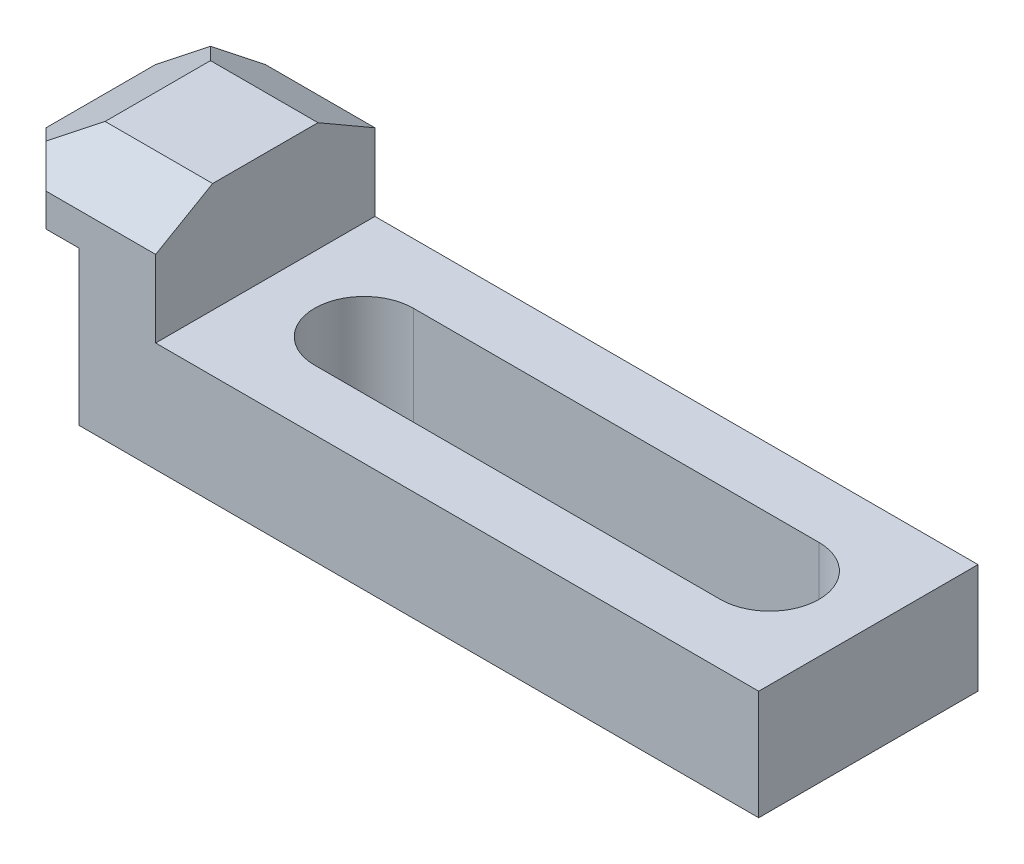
from build123d import *
from OCP.BRepFilletAPI import BRepFilletAPI_MakeChamfer

# Parameters (mm, degrees)
EXTRUDE1_DEPTH = 10
CHAMFER1_SIZE  = 3
CHAMFER1_SIZE2 = 5.196152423
EXTRUDE2_DEPTH = 74.484692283


with BuildPart() as part:
    # Sketch1 → Extrude1 (new, symmetric)
    with BuildSketch(Plane.XY):
        Polygon((0, 0), (8, 0), (8, -14), (70, -14), (70, -4), (15, -4), (15, 6), (0, 6), align=None)
    extrude(amount=EXTRUDE1_DEPTH, both=True)

    # Chamfer1: one chamfer whose edges measure the first distance from different faces: ONE call of the kernel's chamfer builder (chamfer() names one face for all edges)
    chamfer1_edges_1 = [part.edges().sort_by_distance(p)[0] for p in [
        (0, 6, 0),
    ]]
    chamfer1_side_1 = [part.faces().sort_by_distance(p)[0] for p in [
        (0, 3, 0),
    ]]
    chamfer1_edges_2 = [part.edges().sort_by_distance(p)[0] for p in [
        (7.5, 6, 10),
    ]]
    chamfer1_side_2 = [part.faces().sort_by_distance(p)[0] for p in [
        (34.115176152, -7.27100271, 10),
    ]]
    chamfer1_edges_3 = [part.edges().sort_by_distance(p)[0] for p in [
        (7.5, 6, -10),
    ]]
    chamfer1_side_3 = [part.faces().sort_by_distance(p)[0] for p in [
        (34.115176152, -7.27100271, -10),
    ]]
    chamfer1 = BRepFilletAPI_MakeChamfer(part.part.solid().wrapped)
    for e in chamfer1_edges_1:
        chamfer1.Add(CHAMFER1_SIZE, CHAMFER1_SIZE2, e.wrapped, chamfer1_side_1[0].wrapped)  # the first distance lies on this face
    for e in chamfer1_edges_2:
        chamfer1.Add(CHAMFER1_SIZE, CHAMFER1_SIZE2, e.wrapped, chamfer1_side_2[0].wrapped)  # the first distance lies on this face
    for e in chamfer1_edges_3:
        chamfer1.Add(CHAMFER1_SIZE, CHAMFER1_SIZE2, e.wrapped, chamfer1_side_3[0].wrapped)  # the first distance lies on this face
    add(Compound.cast(chamfer1.Shape()), mode=Mode.REPLACE)

    # Sketch2 → Extrude2 (cut, through all)
    with BuildSketch(Plane.XZ.offset(14)):
        with BuildLine():
            Line((24, 4.5), (61, 4.5))
            ThreePointArc((61, 4.5), (65.5, 0), (61, -4.5))
            Line((61, -4.5), (24, -4.5))
            ThreePointArc((24, -4.5), (19.5, 0), (24, 4.5))
        make_face()
        Polygon((0, 10), (5, 10), (0, 5), align=None)
        Polygon((0, -5), (0, -10), (5, -10), align=None)
    extrude(amount=-EXTRUDE2_DEPTH, mode=Mode.SUBTRACT)


solid = part.part
